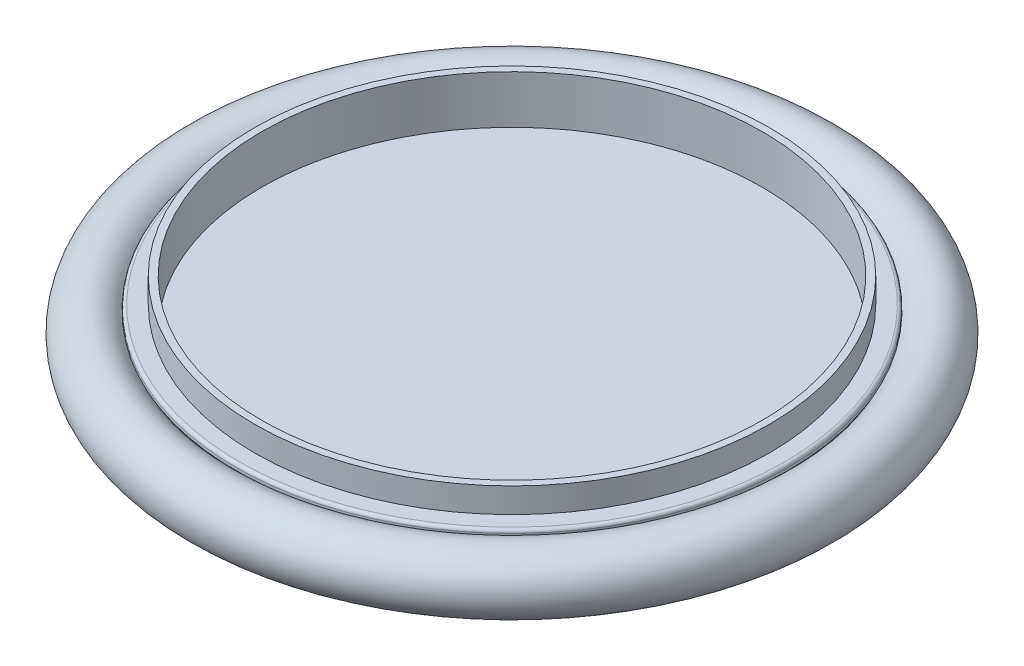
ISO-10303-21;
HEADER;
FILE_DESCRIPTION(('STEP AP214'),'2;1');
FILE_NAME('part.step','',(''),(''),'','','');
FILE_SCHEMA(('AUTOMOTIVE_DESIGN { 1 0 10303 214 1 1 1 1 }'));
ENDSEC;
DATA;
#1=APPLICATION_CONTEXT('core data for automotive mechanical design processes');
#2=APPLICATION_PROTOCOL_DEFINITION('international standard','automotive_design',2000,#1);
#3=PRODUCT_CONTEXT('',#1,'mechanical');
#4=PRODUCT('Part','Part','',(#3));
#5=PRODUCT_RELATED_PRODUCT_CATEGORY('part','',(#4));
#6=PRODUCT_DEFINITION_FORMATION('','',#4);
#7=PRODUCT_DEFINITION_CONTEXT('part definition',#1,'design');
#8=PRODUCT_DEFINITION('design','',#6,#7);
#9=PRODUCT_DEFINITION_SHAPE('','',#8);
#10=(LENGTH_UNIT() NAMED_UNIT(*) SI_UNIT(.MILLI.,.METRE.));
#11=(NAMED_UNIT(*) PLANE_ANGLE_UNIT() SI_UNIT($,.RADIAN.));
#12=(NAMED_UNIT(*) SI_UNIT($,.STERADIAN.) SOLID_ANGLE_UNIT());
#13=UNCERTAINTY_MEASURE_WITH_UNIT(LENGTH_MEASURE(1.E-05),#10,'distance_accuracy_value','');
#14=(GEOMETRIC_REPRESENTATION_CONTEXT(3) GLOBAL_UNCERTAINTY_ASSIGNED_CONTEXT((#13)) GLOBAL_UNIT_ASSIGNED_CONTEXT((#10,
#11,#12)) REPRESENTATION_CONTEXT('',''));
#15=CARTESIAN_POINT('',(0.,0.,0.));
#16=DIRECTION('',(0.,0.,1.));
#17=DIRECTION('',(1.,0.,0.));
#18=AXIS2_PLACEMENT_3D('',#15,#16,#17);
#19=CARTESIAN_POINT('',(0.,0.,0.));
#20=DIRECTION('',(0.,1.,0.));
#21=DIRECTION('',(0.,0.,1.));
#22=AXIS2_PLACEMENT_3D('',#19,#20,#21);
#23=TOROIDAL_SURFACE('',#22,23.8823500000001,2.38125);
#24=ADVANCED_FACE('P0_F13',(),#23,.T.);
#25=CLOSED_SHELL('',(#24));
#26=MANIFOLD_SOLID_BREP('P0_B1',#25);
#27=CARTESIAN_POINT('',(0.,0.,0.));
#28=DIRECTION('',(0.,1.,0.));
#29=DIRECTION('',(-1.,0.,0.));
#30=AXIS2_PLACEMENT_3D('',#27,#28,#29);
#31=TOROIDAL_SURFACE('',#30,24.0411,2.54);
#32=CARTESIAN_POINT('',(0.,1.47183082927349,0.));
#33=DIRECTION('',(0.,1.,0.));
#34=DIRECTION('',(-1.,0.,0.));
#35=AXIS2_PLACEMENT_3D('',#32,#33,#34);
#36=CIRCLE('',#35,21.971);
#37=CARTESIAN_POINT('',(-21.9709999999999,1.47183082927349,0.));
#38=VERTEX_POINT('',#37);
#39=EDGE_CURVE('P1_E163',#38,#38,#36,.T.);
#40=ORIENTED_EDGE('',*,*,#39,.F.);
#41=EDGE_LOOP('',(#40));
#42=FACE_BOUND('',#41,.T.);
#43=CARTESIAN_POINT('',(0.,-1.47183082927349,0.));
#44=DIRECTION('',(0.,1.,0.));
#45=DIRECTION('',(-1.,0.,0.));
#46=AXIS2_PLACEMENT_3D('',#43,#44,#45);
#47=CIRCLE('',#46,21.971);
#48=CARTESIAN_POINT('',(-21.9709999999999,-1.4718308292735,0.));
#49=VERTEX_POINT('',#48);
#50=EDGE_CURVE('P1_E165',#49,#49,#47,.F.);
#51=ORIENTED_EDGE('',*,*,#50,.F.);
#52=EDGE_LOOP('',(#51));
#53=FACE_BOUND('',#52,.T.);
#54=ADVANCED_FACE('P1_F16',(#42,#53),#31,.F.);
#55=CARTESIAN_POINT('',(0.,0.,0.));
#56=DIRECTION('',(0.,1.,0.));
#57=DIRECTION('',(-1.,0.,0.));
#58=AXIS2_PLACEMENT_3D('',#55,#56,#57);
#59=CYLINDRICAL_SURFACE('',#58,21.971);
#60=ORIENTED_EDGE('',*,*,#39,.T.);
#61=EDGE_LOOP('',(#60));
#62=FACE_BOUND('',#61,.T.);
#63=CARTESIAN_POINT('',(0.,1.7018,0.));
#64=DIRECTION('',(0.,1.,0.));
#65=DIRECTION('',(-1.,0.,0.));
#66=AXIS2_PLACEMENT_3D('',#63,#64,#65);
#67=CIRCLE('',#66,21.971);
#68=CARTESIAN_POINT('',(-21.9710000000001,1.7018,0.));
#69=VERTEX_POINT('',#68);
#70=EDGE_CURVE('P1_E167',#69,#69,#67,.T.);
#71=ORIENTED_EDGE('',*,*,#70,.F.);
#72=EDGE_LOOP('',(#71));
#73=FACE_BOUND('',#72,.T.);
#74=ADVANCED_FACE('P1_F82',(#62,#73),#59,.T.);
#75=CARTESIAN_POINT('',(0.,0.,0.));
#76=DIRECTION('',(0.,1.,0.));
#77=DIRECTION('',(-1.,0.,0.));
#78=AXIS2_PLACEMENT_3D('',#75,#76,#77);
#79=CYLINDRICAL_SURFACE('',#78,21.971);
#80=CARTESIAN_POINT('',(0.,-1.7018,0.));
#81=DIRECTION('',(0.,1.,0.));
#82=DIRECTION('',(-1.,0.,0.));
#83=AXIS2_PLACEMENT_3D('',#80,#81,#82);
#84=CIRCLE('',#83,21.971);
#85=CARTESIAN_POINT('',(-21.9709999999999,-1.70180000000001,0.));
#86=VERTEX_POINT('',#85);
#87=EDGE_CURVE('P1_E52',#86,#86,#84,.F.);
#88=ORIENTED_EDGE('',*,*,#87,.F.);
#89=EDGE_LOOP('',(#88));
#90=FACE_BOUND('',#89,.T.);
#91=ORIENTED_EDGE('',*,*,#50,.T.);
#92=EDGE_LOOP('',(#91));
#93=FACE_BOUND('',#92,.T.);
#94=ADVANCED_FACE('P1_F75',(#90,#93),#79,.T.);
#95=CARTESIAN_POINT('',(0.,1.70180000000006,0.));
#96=DIRECTION('',(0.,1.,0.));
#97=DIRECTION('',(-1.,0.,0.));
#98=AXIS2_PLACEMENT_3D('',#95,#96,#97);
#99=TOROIDAL_SURFACE('',#98,21.717,0.253999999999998);
#100=ORIENTED_EDGE('',*,*,#70,.T.);
#101=EDGE_LOOP('',(#100));
#102=FACE_BOUND('',#101,.T.);
#103=CARTESIAN_POINT('',(0.,1.95580000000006,0.));
#104=DIRECTION('',(0.,-1.,0.));
#105=DIRECTION('',(-1.,0.,0.));
#106=AXIS2_PLACEMENT_3D('',#103,#104,#105);
#107=CIRCLE('',#106,21.717);
#108=CARTESIAN_POINT('',(21.717,1.95580000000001,2.22044604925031E-13));
#109=VERTEX_POINT('',#108);
#110=CARTESIAN_POINT('',(-21.717,1.95579999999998,0.));
#111=VERTEX_POINT('',#110);
#112=EDGE_CURVE('P1_E45',#109,#111,#107,.F.);
#113=ORIENTED_EDGE('',*,*,#112,.F.);
#114=CARTESIAN_POINT('',(0.,1.95580000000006,0.));
#115=DIRECTION('',(0.,-1.,0.));
#116=DIRECTION('',(1.,0.,0.));
#117=AXIS2_PLACEMENT_3D('',#114,#115,#116);
#118=CIRCLE('',#117,21.717);
#119=EDGE_CURVE('P1_E48',#111,#109,#118,.F.);
#120=ORIENTED_EDGE('',*,*,#119,.F.);
#121=EDGE_LOOP('',(#113,#120));
#122=FACE_BOUND('',#121,.T.);
#123=ADVANCED_FACE('P1_F56',(#102,#122),#99,.T.);
#124=CARTESIAN_POINT('',(0.,-1.70180000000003,0.));
#125=DIRECTION('',(0.,1.,0.));
#126=DIRECTION('',(-1.,0.,0.));
#127=AXIS2_PLACEMENT_3D('',#124,#125,#126);
#128=TOROIDAL_SURFACE('',#127,21.717,0.253999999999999);
#129=CARTESIAN_POINT('',(0.,-1.95580000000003,0.));
#130=DIRECTION('',(0.,1.,0.));
#131=DIRECTION('',(-1.,0.,0.));
#132=AXIS2_PLACEMENT_3D('',#129,#130,#131);
#133=CIRCLE('',#132,21.717);
#134=CARTESIAN_POINT('',(21.717,-1.95580000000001,2.22044604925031E-13));
#135=VERTEX_POINT('',#134);
#136=CARTESIAN_POINT('',(-21.717,-1.95580000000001,0.));
#137=VERTEX_POINT('',#136);
#138=EDGE_CURVE('P1_E36',#135,#137,#133,.F.);
#139=ORIENTED_EDGE('',*,*,#138,.F.);
#140=CARTESIAN_POINT('',(0.,-1.95580000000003,0.));
#141=DIRECTION('',(0.,1.,0.));
#142=DIRECTION('',(1.,0.,0.));
#143=AXIS2_PLACEMENT_3D('',#140,#141,#142);
#144=CIRCLE('',#143,21.717);
#145=EDGE_CURVE('P1_E134',#137,#135,#144,.F.);
#146=ORIENTED_EDGE('',*,*,#145,.F.);
#147=EDGE_LOOP('',(#139,#146));
#148=FACE_BOUND('',#147,.T.);
#149=ORIENTED_EDGE('',*,*,#87,.T.);
#150=EDGE_LOOP('',(#149));
#151=FACE_BOUND('',#150,.T.);
#152=ADVANCED_FACE('P1_F74',(#148,#151),#128,.T.);
#153=CARTESIAN_POINT('',(-20.4978,1.95579999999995,0.));
#154=DIRECTION('',(0.,1.,0.));
#155=DIRECTION('',(-1.,0.,0.));
#156=AXIS2_PLACEMENT_3D('',#153,#154,#155);
#157=PLANE('',#156);
#158=CARTESIAN_POINT('',(0.,1.95579999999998,2.22044604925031E-13));
#159=DIRECTION('',(0.,1.,0.));
#160=DIRECTION('',(-1.,0.,0.));
#161=AXIS2_PLACEMENT_3D('',#158,#159,#160);
#162=CIRCLE('',#161,20.4978);
#163=CARTESIAN_POINT('',(-20.4978000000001,1.95579999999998,2.20906748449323E-13));
#164=VERTEX_POINT('',#163);
#165=EDGE_CURVE('P1_E138',#164,#164,#162,.T.);
#166=ORIENTED_EDGE('',*,*,#165,.F.);
#167=EDGE_LOOP('',(#166));
#168=FACE_BOUND('',#167,.T.);
#169=ORIENTED_EDGE('',*,*,#119,.T.);
#170=ORIENTED_EDGE('',*,*,#112,.T.);
#171=EDGE_LOOP('',(#169,#170));
#172=FACE_BOUND('',#171,.T.);
#173=ADVANCED_FACE('P1_F50',(#168,#172),#157,.T.);
#174=CARTESIAN_POINT('',(-20.4978000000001,-1.95580000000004,0.));
#175=DIRECTION('',(0.,-1.,0.));
#176=DIRECTION('',(1.,0.,0.));
#177=AXIS2_PLACEMENT_3D('',#174,#175,#176);
#178=PLANE('',#177);
#179=ORIENTED_EDGE('',*,*,#138,.T.);
#180=ORIENTED_EDGE('',*,*,#145,.T.);
#181=EDGE_LOOP('',(#179,#180));
#182=FACE_BOUND('',#181,.T.);
#183=CARTESIAN_POINT('',(0.,-1.95579999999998,0.));
#184=DIRECTION('',(0.,1.,0.));
#185=DIRECTION('',(-1.,0.,0.));
#186=AXIS2_PLACEMENT_3D('',#183,#184,#185);
#187=CIRCLE('',#186,20.4978);
#188=CARTESIAN_POINT('',(-20.4978,-1.95579999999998,0.));
#189=VERTEX_POINT('',#188);
#190=EDGE_CURVE('P1_E152',#189,#189,#187,.F.);
#191=ORIENTED_EDGE('',*,*,#190,.F.);
#192=EDGE_LOOP('',(#191));
#193=FACE_BOUND('',#192,.T.);
#194=ADVANCED_FACE('P1_F117',(#182,#193),#178,.T.);
#195=CARTESIAN_POINT('',(0.,0.,0.));
#196=DIRECTION('',(0.,1.,0.));
#197=DIRECTION('',(-1.,0.,0.));
#198=AXIS2_PLACEMENT_3D('',#195,#196,#197);
#199=CYLINDRICAL_SURFACE('',#198,20.4978);
#200=ORIENTED_EDGE('',*,*,#165,.T.);
#201=EDGE_LOOP('',(#200));
#202=FACE_BOUND('',#201,.T.);
#203=CARTESIAN_POINT('',(0.,3.937,2.22044604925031E-13));
#204=DIRECTION('',(0.,1.,0.));
#205=DIRECTION('',(-1.,0.,0.));
#206=AXIS2_PLACEMENT_3D('',#203,#204,#205);
#207=CIRCLE('',#206,20.4978);
#208=CARTESIAN_POINT('',(-20.4978,3.93699999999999,2.20906748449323E-13));
#209=VERTEX_POINT('',#208);
#210=EDGE_CURVE('P1_E155',#209,#209,#207,.T.);
#211=ORIENTED_EDGE('',*,*,#210,.F.);
#212=EDGE_LOOP('',(#211));
#213=FACE_BOUND('',#212,.T.);
#214=ADVANCED_FACE('P1_F113',(#202,#213),#199,.T.);
#215=CARTESIAN_POINT('',(0.,0.,0.));
#216=DIRECTION('',(0.,1.,0.));
#217=DIRECTION('',(-1.,0.,0.));
#218=AXIS2_PLACEMENT_3D('',#215,#216,#217);
#219=CYLINDRICAL_SURFACE('',#218,20.4978);
#220=CARTESIAN_POINT('',(0.,-3.937,0.));
#221=DIRECTION('',(0.,1.,0.));
#222=DIRECTION('',(-1.,0.,0.));
#223=AXIS2_PLACEMENT_3D('',#220,#221,#222);
#224=CIRCLE('',#223,20.4978);
#225=CARTESIAN_POINT('',(-20.4978000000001,-3.937,0.));
#226=VERTEX_POINT('',#225);
#227=EDGE_CURVE('P1_E158',#226,#226,#224,.F.);
#228=ORIENTED_EDGE('',*,*,#227,.F.);
#229=EDGE_LOOP('',(#228));
#230=FACE_BOUND('',#229,.T.);
#231=ORIENTED_EDGE('',*,*,#190,.T.);
#232=EDGE_LOOP('',(#231));
#233=FACE_BOUND('',#232,.T.);
#234=ADVANCED_FACE('P1_F109',(#230,#233),#219,.T.);
#235=CARTESIAN_POINT('',(-19.939,3.93700000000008,0.));
#236=DIRECTION('',(0.,1.,0.));
#237=DIRECTION('',(-1.,0.,0.));
#238=AXIS2_PLACEMENT_3D('',#235,#236,#237);
#239=PLANE('',#238);
#240=CARTESIAN_POINT('',(0.,3.937,2.22044604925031E-13));
#241=DIRECTION('',(0.,1.,0.));
#242=DIRECTION('',(-1.,0.,0.));
#243=AXIS2_PLACEMENT_3D('',#240,#241,#242);
#244=CIRCLE('',#243,19.939);
#245=CARTESIAN_POINT('',(-19.939,3.93699999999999,2.20937768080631E-13));
#246=VERTEX_POINT('',#245);
#247=EDGE_CURVE('P1_E28',#246,#246,#244,.F.);
#248=ORIENTED_EDGE('',*,*,#247,.T.);
#249=EDGE_LOOP('',(#248));
#250=FACE_BOUND('',#249,.T.);
#251=ORIENTED_EDGE('',*,*,#210,.T.);
#252=EDGE_LOOP('',(#251));
#253=FACE_BOUND('',#252,.T.);
#254=ADVANCED_FACE('P1_F101',(#250,#253),#239,.T.);
#255=CARTESIAN_POINT('',(-19.939,-3.93699999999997,0.));
#256=DIRECTION('',(0.,-1.,0.));
#257=DIRECTION('',(1.,0.,0.));
#258=AXIS2_PLACEMENT_3D('',#255,#256,#257);
#259=PLANE('',#258);
#260=ORIENTED_EDGE('',*,*,#227,.T.);
#261=EDGE_LOOP('',(#260));
#262=FACE_BOUND('',#261,.T.);
#263=CARTESIAN_POINT('',(0.,-3.937,0.));
#264=DIRECTION('',(0.,1.,0.));
#265=DIRECTION('',(-1.,0.,0.));
#266=AXIS2_PLACEMENT_3D('',#263,#264,#265);
#267=CIRCLE('',#266,19.939);
#268=CARTESIAN_POINT('',(-19.9390000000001,-3.937,0.));
#269=VERTEX_POINT('',#268);
#270=EDGE_CURVE('P1_E11',#269,#269,#267,.T.);
#271=ORIENTED_EDGE('',*,*,#270,.T.);
#272=EDGE_LOOP('',(#271));
#273=FACE_BOUND('',#272,.T.);
#274=ADVANCED_FACE('P1_F95',(#262,#273),#259,.T.);
#275=CARTESIAN_POINT('',(0.,0.,0.));
#276=DIRECTION('',(0.,1.,0.));
#277=DIRECTION('',(-1.,0.,0.));
#278=AXIS2_PLACEMENT_3D('',#275,#276,#277);
#279=CYLINDRICAL_SURFACE('',#278,19.939);
#280=ORIENTED_EDGE('',*,*,#247,.F.);
#281=EDGE_LOOP('',(#280));
#282=FACE_BOUND('',#281,.T.);
#283=ORIENTED_EDGE('',*,*,#270,.F.);
#284=EDGE_LOOP('',(#283));
#285=FACE_BOUND('',#284,.T.);
#286=ADVANCED_FACE('P1_F93',(#282,#285),#279,.F.);
#287=CLOSED_SHELL('',(#54,#74,#94,#123,#152,#173,#194,#214,#234,#254,#274,#286));
#288=MANIFOLD_SOLID_BREP('P1_B1',#287);
#289=CARTESIAN_POINT('',(0.,-0.101599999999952,2.22044604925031E-13));
#290=DIRECTION('',(0.,1.,0.));
#291=DIRECTION('',(0.,0.,1.));
#292=AXIS2_PLACEMENT_3D('',#289,#290,#291);
#293=PLANE('',#292);
#294=CARTESIAN_POINT('',(0.,-0.101599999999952,2.22044604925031E-13));
#295=DIRECTION('',(0.,1.,0.));
#296=DIRECTION('',(0.,0.,1.));
#297=AXIS2_PLACEMENT_3D('',#294,#295,#296);
#298=CIRCLE('',#297,17.145);
#299=CARTESIAN_POINT('',(0.,-0.101599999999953,17.1450000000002));
#300=VERTEX_POINT('',#299);
#301=EDGE_CURVE('P2_E19',#300,#300,#298,.F.);
#302=ORIENTED_EDGE('',*,*,#301,.T.);
#303=EDGE_LOOP('',(#302));
#304=FACE_BOUND('',#303,.T.);
#305=ADVANCED_FACE('P2_F16',(#304),#293,.F.);
#306=CARTESIAN_POINT('',(0.,-59.6864299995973,2.22044604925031E-13));
#307=DIRECTION('',(0.,1.,0.));
#308=DIRECTION('',(0.,0.,1.));
#309=AXIS2_PLACEMENT_3D('',#306,#307,#308);
#310=CYLINDRICAL_SURFACE('',#309,17.145);
#311=CARTESIAN_POINT('',(0.,-3.937,0.));
#312=DIRECTION('',(0.,1.,0.));
#313=DIRECTION('',(0.,0.,1.));
#314=AXIS2_PLACEMENT_3D('',#311,#312,#313);
#315=CIRCLE('',#314,17.145);
#316=CARTESIAN_POINT('',(0.,-3.937,17.145));
#317=VERTEX_POINT('',#316);
#318=EDGE_CURVE('P2_E41',#317,#317,#315,.F.);
#319=ORIENTED_EDGE('',*,*,#318,.T.);
#320=EDGE_LOOP('',(#319));
#321=FACE_BOUND('',#320,.T.);
#322=ORIENTED_EDGE('',*,*,#301,.F.);
#323=EDGE_LOOP('',(#322));
#324=FACE_BOUND('',#323,.T.);
#325=ADVANCED_FACE('P2_F49',(#321,#324),#310,.F.);
#326=CARTESIAN_POINT('',(-19.939,-3.93699999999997,0.));
#327=DIRECTION('',(0.,1.,0.));
#328=DIRECTION('',(0.,0.,1.));
#329=AXIS2_PLACEMENT_3D('',#326,#327,#328);
#330=PLANE('',#329);
#331=CARTESIAN_POINT('',(0.,-3.937,0.));
#332=DIRECTION('',(0.,1.,0.));
#333=DIRECTION('',(0.,0.,1.));
#334=AXIS2_PLACEMENT_3D('',#331,#332,#333);
#335=CIRCLE('',#334,19.7104);
#336=CARTESIAN_POINT('',(0.,-3.937,19.7104));
#337=VERTEX_POINT('',#336);
#338=EDGE_CURVE('P2_E39',#337,#337,#335,.T.);
#339=ORIENTED_EDGE('',*,*,#338,.F.);
#340=EDGE_LOOP('',(#339));
#341=FACE_BOUND('',#340,.T.);
#342=ORIENTED_EDGE('',*,*,#318,.F.);
#343=EDGE_LOOP('',(#342));
#344=FACE_BOUND('',#343,.T.);
#345=ADVANCED_FACE('P2_F51',(#341,#344),#330,.F.);
#346=CARTESIAN_POINT('',(0.,-59.6864299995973,2.22044604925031E-13));
#347=DIRECTION('',(0.,1.,0.));
#348=DIRECTION('',(0.,0.,1.));
#349=AXIS2_PLACEMENT_3D('',#346,#347,#348);
#350=CYLINDRICAL_SURFACE('',#349,19.7104);
#351=ORIENTED_EDGE('',*,*,#338,.T.);
#352=EDGE_LOOP('',(#351));
#353=FACE_BOUND('',#352,.T.);
#354=CARTESIAN_POINT('',(0.,-0.101599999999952,2.22044604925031E-13));
#355=DIRECTION('',(0.,1.,0.));
#356=DIRECTION('',(0.,0.,1.));
#357=AXIS2_PLACEMENT_3D('',#354,#355,#356);
#358=CIRCLE('',#357,19.7104);
#359=CARTESIAN_POINT('',(0.,-0.101599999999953,19.7104000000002));
#360=VERTEX_POINT('',#359);
#361=EDGE_CURVE('P2_E36',#360,#360,#358,.F.);
#362=ORIENTED_EDGE('',*,*,#361,.T.);
#363=EDGE_LOOP('',(#362));
#364=FACE_BOUND('',#363,.T.);
#365=ADVANCED_FACE('P2_F57',(#353,#364),#350,.T.);
#366=CARTESIAN_POINT('',(0.,-0.101599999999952,2.22044604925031E-13));
#367=DIRECTION('',(0.,1.,0.));
#368=DIRECTION('',(0.,0.,1.));
#369=AXIS2_PLACEMENT_3D('',#366,#367,#368);
#370=PLANE('',#369);
#371=ORIENTED_EDGE('',*,*,#361,.F.);
#372=EDGE_LOOP('',(#371));
#373=FACE_BOUND('',#372,.T.);
#374=CARTESIAN_POINT('',(0.,-0.101599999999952,2.22044604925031E-13));
#375=DIRECTION('',(0.,-1.,0.));
#376=DIRECTION('',(0.,0.,-1.));
#377=AXIS2_PLACEMENT_3D('',#374,#375,#376);
#378=CIRCLE('',#377,19.7358);
#379=CARTESIAN_POINT('',(0.,-0.101599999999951,-19.7357999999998));
#380=VERTEX_POINT('',#379);
#381=EDGE_CURVE('P2_E33',#380,#380,#378,.T.);
#382=ORIENTED_EDGE('',*,*,#381,.T.);
#383=EDGE_LOOP('',(#382));
#384=FACE_BOUND('',#383,.T.);
#385=ADVANCED_FACE('P2_F78',(#373,#384),#370,.F.);
#386=CARTESIAN_POINT('',(0.,-3.937,0.));
#387=DIRECTION('',(0.,-1.,0.));
#388=DIRECTION('',(0.,0.,-1.));
#389=AXIS2_PLACEMENT_3D('',#386,#387,#388);
#390=CYLINDRICAL_SURFACE('',#389,19.7358);
#391=ORIENTED_EDGE('',*,*,#381,.F.);
#392=EDGE_LOOP('',(#391));
#393=FACE_BOUND('',#392,.T.);
#394=CARTESIAN_POINT('',(0.,-3.937,0.));
#395=DIRECTION('',(0.,-1.,0.));
#396=DIRECTION('',(0.,0.,-1.));
#397=AXIS2_PLACEMENT_3D('',#394,#395,#396);
#398=CIRCLE('',#397,19.7358);
#399=CARTESIAN_POINT('',(0.,-3.937,-19.7358));
#400=VERTEX_POINT('',#399);
#401=EDGE_CURVE('P2_E28',#400,#400,#398,.T.);
#402=ORIENTED_EDGE('',*,*,#401,.T.);
#403=EDGE_LOOP('',(#402));
#404=FACE_BOUND('',#403,.T.);
#405=ADVANCED_FACE('P2_F74',(#393,#404),#390,.F.);
#406=CARTESIAN_POINT('',(-19.939,-3.93699999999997,0.));
#407=DIRECTION('',(0.,1.,0.));
#408=DIRECTION('',(0.,0.,1.));
#409=AXIS2_PLACEMENT_3D('',#406,#407,#408);
#410=PLANE('',#409);
#411=CARTESIAN_POINT('',(0.,-3.937,0.));
#412=DIRECTION('',(0.,-1.,0.));
#413=DIRECTION('',(0.,0.,-1.));
#414=AXIS2_PLACEMENT_3D('',#411,#412,#413);
#415=CIRCLE('',#414,19.939);
#416=CARTESIAN_POINT('',(0.,-3.937,-19.939));
#417=VERTEX_POINT('',#416);
#418=EDGE_CURVE('P2_E23',#417,#417,#415,.F.);
#419=ORIENTED_EDGE('',*,*,#418,.F.);
#420=EDGE_LOOP('',(#419));
#421=FACE_BOUND('',#420,.T.);
#422=ORIENTED_EDGE('',*,*,#401,.F.);
#423=EDGE_LOOP('',(#422));
#424=FACE_BOUND('',#423,.T.);
#425=ADVANCED_FACE('P2_F68',(#421,#424),#410,.F.);
#426=CARTESIAN_POINT('',(0.,-3.937,0.));
#427=DIRECTION('',(0.,-1.,0.));
#428=DIRECTION('',(0.,0.,-1.));
#429=AXIS2_PLACEMENT_3D('',#426,#427,#428);
#430=CYLINDRICAL_SURFACE('',#429,19.939);
#431=ORIENTED_EDGE('',*,*,#418,.T.);
#432=EDGE_LOOP('',(#431));
#433=FACE_BOUND('',#432,.T.);
#434=CARTESIAN_POINT('',(0.,0.101599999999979,0.));
#435=DIRECTION('',(0.,-1.,0.));
#436=DIRECTION('',(0.,0.,-1.));
#437=AXIS2_PLACEMENT_3D('',#434,#435,#436);
#438=CIRCLE('',#437,19.939);
#439=CARTESIAN_POINT('',(0.,0.101599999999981,-19.939));
#440=VERTEX_POINT('',#439);
#441=EDGE_CURVE('P2_E10',#440,#440,#438,.T.);
#442=ORIENTED_EDGE('',*,*,#441,.T.);
#443=EDGE_LOOP('',(#442));
#444=FACE_BOUND('',#443,.T.);
#445=ADVANCED_FACE('P2_F62',(#433,#444),#430,.T.);
#446=CARTESIAN_POINT('',(0.,0.101599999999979,0.));
#447=DIRECTION('',(0.,-1.,0.));
#448=DIRECTION('',(0.,0.,-1.));
#449=AXIS2_PLACEMENT_3D('',#446,#447,#448);
#450=PLANE('',#449);
#451=ORIENTED_EDGE('',*,*,#441,.F.);
#452=EDGE_LOOP('',(#451));
#453=FACE_BOUND('',#452,.T.);
#454=ADVANCED_FACE('P2_F60',(#453),#450,.F.);
#455=CLOSED_SHELL('',(#305,#325,#345,#365,#385,#405,#425,#445,#454));
#456=MANIFOLD_SOLID_BREP('P2_B1',#455);
#457=ADVANCED_BREP_SHAPE_REPRESENTATION('',(#18,#26,#288,#456),#14);
#458=SHAPE_DEFINITION_REPRESENTATION(#9,#457);
ENDSEC;
END-ISO-10303-21;
